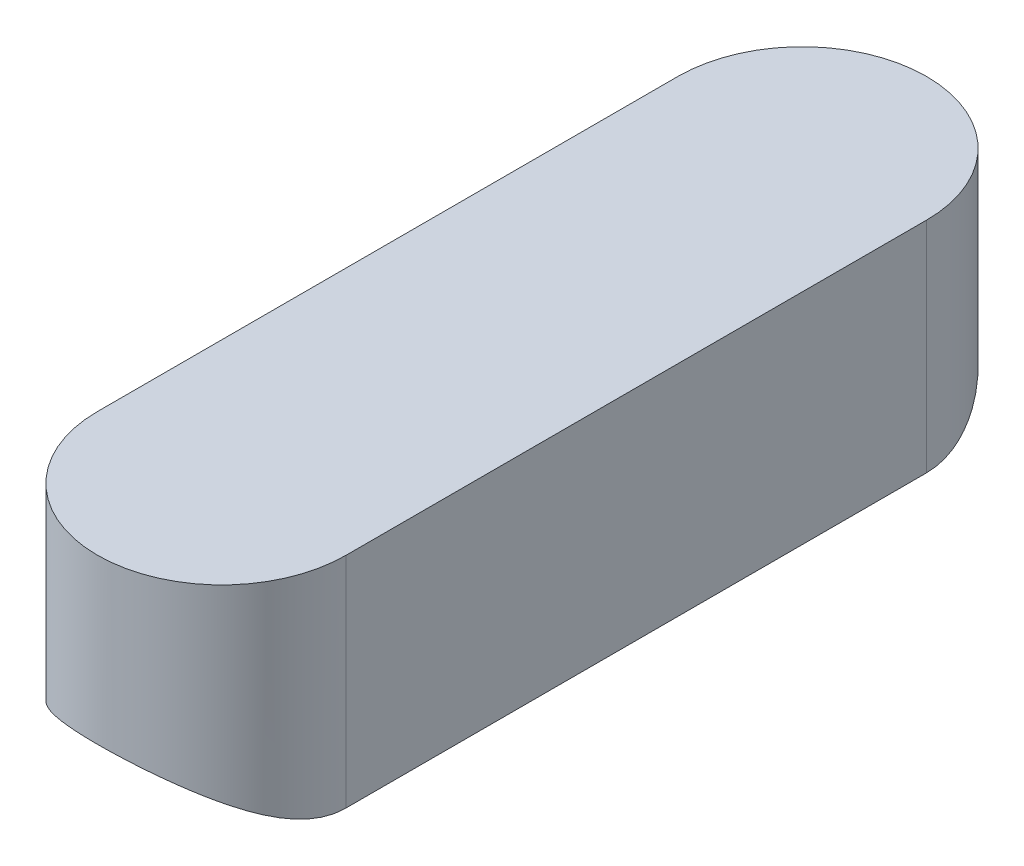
ISO-10303-21;
HEADER;
FILE_DESCRIPTION(('STEP AP214'),'2;1');
FILE_NAME('part.step','',(''),(''),'','','');
FILE_SCHEMA(('AUTOMOTIVE_DESIGN { 1 0 10303 214 1 1 1 1 }'));
ENDSEC;
DATA;
#1=APPLICATION_CONTEXT('core data for automotive mechanical design processes');
#2=APPLICATION_PROTOCOL_DEFINITION('international standard','automotive_design',2000,#1);
#3=PRODUCT_CONTEXT('',#1,'mechanical');
#4=PRODUCT('Part','Part','',(#3));
#5=PRODUCT_RELATED_PRODUCT_CATEGORY('part','',(#4));
#6=PRODUCT_DEFINITION_FORMATION('','',#4);
#7=PRODUCT_DEFINITION_CONTEXT('part definition',#1,'design');
#8=PRODUCT_DEFINITION('design','',#6,#7);
#9=PRODUCT_DEFINITION_SHAPE('','',#8);
#10=(LENGTH_UNIT() NAMED_UNIT(*) SI_UNIT(.MILLI.,.METRE.));
#11=(NAMED_UNIT(*) PLANE_ANGLE_UNIT() SI_UNIT($,.RADIAN.));
#12=(NAMED_UNIT(*) SI_UNIT($,.STERADIAN.) SOLID_ANGLE_UNIT());
#13=UNCERTAINTY_MEASURE_WITH_UNIT(LENGTH_MEASURE(1.E-05),#10,'distance_accuracy_value','');
#14=(GEOMETRIC_REPRESENTATION_CONTEXT(3) GLOBAL_UNCERTAINTY_ASSIGNED_CONTEXT((#13)) GLOBAL_UNIT_ASSIGNED_CONTEXT((#10,
#11,#12)) REPRESENTATION_CONTEXT('',''));
#15=CARTESIAN_POINT('',(0.,0.,0.));
#16=DIRECTION('',(0.,0.,1.));
#17=DIRECTION('',(1.,0.,0.));
#18=AXIS2_PLACEMENT_3D('',#15,#16,#17);
#19=CARTESIAN_POINT('',(0.,0.,20.));
#20=DIRECTION('',(0.,0.,-1.));
#21=DIRECTION('',(-1.,0.,0.));
#22=AXIS2_PLACEMENT_3D('',#19,#20,#21);
#23=CYLINDRICAL_SURFACE('',#22,4.05);
#24=CARTESIAN_POINT('',(3.,2.72075357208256,3.));
#25=CARTESIAN_POINT('',(3.00002247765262,2.72069902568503,2.92893320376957));
#26=CARTESIAN_POINT('',(2.9974758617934,2.72353662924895,2.85790350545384));
#27=CARTESIAN_POINT('',(2.98742856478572,2.73456916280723,2.71675055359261));
#28=CARTESIAN_POINT('',(2.97993767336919,2.74275350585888,2.64662578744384));
#29=CARTESIAN_POINT('',(2.96030761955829,2.76392301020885,2.50869301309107));
#30=CARTESIAN_POINT('',(2.94822749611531,2.77684712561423,2.4408670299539));
#31=CARTESIAN_POINT('',(2.91968140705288,2.80684745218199,2.30707661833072));
#32=CARTESIAN_POINT('',(2.90321345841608,2.82392554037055,2.24111304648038));
#33=CARTESIAN_POINT('',(2.84793349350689,2.8800177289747,2.04754165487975));
#34=CARTESIAN_POINT('',(2.80307107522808,2.92409137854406,1.92308432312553));
#35=CARTESIAN_POINT('',(2.69888349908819,3.02052769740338,1.68348791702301));
#36=CARTESIAN_POINT('',(2.63950627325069,3.07291996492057,1.56838442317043));
#37=CARTESIAN_POINT('',(2.494211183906,3.19247958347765,1.32587832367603));
#38=CARTESIAN_POINT('',(2.40535804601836,3.26050118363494,1.20064763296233));
#39=CARTESIAN_POINT('',(2.2095996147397,3.39623719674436,0.965012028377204));
#40=CARTESIAN_POINT('',(2.10268421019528,3.46395141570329,0.854615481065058));
#41=CARTESIAN_POINT('',(1.84834056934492,3.60712007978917,0.629822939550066));
#42=CARTESIAN_POINT('',(1.69708084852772,3.68146836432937,0.518929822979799));
#43=CARTESIAN_POINT('',(1.4532080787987,3.78132761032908,0.373759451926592));
#44=CARTESIAN_POINT('',(1.36911059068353,3.81266355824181,0.328906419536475));
#45=CARTESIAN_POINT('',(1.19569606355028,3.87054975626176,0.246910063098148));
#46=CARTESIAN_POINT('',(1.10638171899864,3.89710244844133,0.209762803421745));
#47=CARTESIAN_POINT('',(0.885804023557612,3.95418137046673,0.130489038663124));
#48=CARTESIAN_POINT('',(0.752275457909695,3.98191883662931,0.0925002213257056));
#49=CARTESIAN_POINT('',(0.479292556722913,4.02390655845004,0.0352565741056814));
#50=CARTESIAN_POINT('',(0.339843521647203,4.03816862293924,0.0159853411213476));
#51=CARTESIAN_POINT('',(0.0585161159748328,4.05202974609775,-0.00274654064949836));
#52=CARTESIAN_POINT('',(-0.0833674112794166,4.05159244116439,-0.00215806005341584));
#53=CARTESIAN_POINT('',(-0.364830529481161,4.03599796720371,0.0189215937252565));
#54=CARTESIAN_POINT('',(-0.504409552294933,4.02083722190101,0.0394176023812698));
#55=CARTESIAN_POINT('',(-0.772870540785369,3.97782350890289,0.0981107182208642));
#56=CARTESIAN_POINT('',(-0.901952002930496,3.95039314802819,0.135719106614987));
#57=CARTESIAN_POINT('',(-1.15156555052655,3.88497957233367,0.226633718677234));
#58=CARTESIAN_POINT('',(-1.27209574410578,3.84699403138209,0.279943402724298));
#59=CARTESIAN_POINT('',(-1.51553866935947,3.75821963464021,0.406931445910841));
#60=CARTESIAN_POINT('',(-1.63727105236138,3.70648501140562,0.482199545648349));
#61=CARTESIAN_POINT('',(-1.86694337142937,3.59628715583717,0.647432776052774));
#62=CARTESIAN_POINT('',(-1.97487171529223,3.53781834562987,0.737410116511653));
#63=CARTESIAN_POINT('',(-2.19579117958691,3.40596149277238,0.94908676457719));
#64=CARTESIAN_POINT('',(-2.30571612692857,3.3318767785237,1.07355491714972));
#65=CARTESIAN_POINT('',(-2.50417490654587,3.18540395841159,1.33967100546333));
#66=CARTESIAN_POINT('',(-2.59269126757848,3.11301728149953,1.48133283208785));
#67=CARTESIAN_POINT('',(-2.73062889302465,2.99211943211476,1.750370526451));
#68=CARTESIAN_POINT('',(-2.7843459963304,2.94175845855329,1.87470193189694));
#69=CARTESIAN_POINT('',(-2.87518758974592,2.8530391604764,2.1328923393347));
#70=CARTESIAN_POINT('',(-2.91238980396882,2.81462487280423,2.26670319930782));
#71=CARTESIAN_POINT('',(-2.95976876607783,2.76461277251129,2.50059787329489));
#72=CARTESIAN_POINT('',(-2.97470902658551,2.74842404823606,2.59871613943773));
#73=CARTESIAN_POINT('',(-2.98980689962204,2.73196023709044,2.74784407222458));
#74=CARTESIAN_POINT('',(-2.99362116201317,2.72777467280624,2.79808040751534));
#75=CARTESIAN_POINT('',(-2.99872079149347,2.72216458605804,2.89887187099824));
#76=CARTESIAN_POINT('',(-3.0000042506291,2.72074214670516,2.94942721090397));
#77=CARTESIAN_POINT('',(-3.,2.72075357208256,3.));
#78=B_SPLINE_CURVE_WITH_KNOTS('',3,(#24,#25,#26,#27,#28,#29,#30,#31,#32,#33,#34,#35,#36,#37,#38,
#39,#40,#41,#42,#43,#44,#45,#46,#47,#48,#49,#50,#51,#52,#53,#54,#55,#56,#57,#58,#59,#60,#61,#62,
#63,#64,#65,#66,#67,#68,#69,#70,#71,#72,#73,#74,#75,#76,#77),.UNSPECIFIED.,.F.,.F.,(4,2,2,2,2,2,
2,2,2,2,2,2,2,2,2,2,2,2,2,2,2,2,2,2,2,2,4),(0.,0.213038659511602,0.425656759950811,
0.635627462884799,0.845693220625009,1.26227494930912,1.68037356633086,2.18243291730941,
2.68477425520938,3.28615805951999,3.5866944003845,3.88707686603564,4.30984375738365,
4.73223982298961,5.15568089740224,5.57922484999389,5.98918653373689,6.39923863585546,
6.8541239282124,7.30938874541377,7.85280607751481,8.39666539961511,8.82878871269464,
9.25885618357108,9.55952855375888,9.71106423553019,9.86271411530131),.UNSPECIFIED.);
#79=CARTESIAN_POINT('',(3.,2.72075357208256,3.));
#80=VERTEX_POINT('',#79);
#81=CARTESIAN_POINT('',(-3.,2.72075357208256,3.));
#82=VERTEX_POINT('',#81);
#83=EDGE_CURVE('E57',#80,#82,#78,.T.);
#84=ORIENTED_EDGE('',*,*,#83,.F.);
#85=DIRECTION('',(0.,0.,-1.));
#86=VECTOR('',#85,1.);
#87=CARTESIAN_POINT('',(3.,2.72075357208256,20.));
#88=LINE('',#87,#86);
#89=CARTESIAN_POINT('',(3.,2.72075357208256,17.));
#90=VERTEX_POINT('',#89);
#91=EDGE_CURVE('E12',#90,#80,#88,.T.);
#92=ORIENTED_EDGE('',*,*,#91,.F.);
#93=CARTESIAN_POINT('',(-3.,2.72075357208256,17.));
#94=CARTESIAN_POINT('',(-3.00002247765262,2.72069902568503,17.0710667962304));
#95=CARTESIAN_POINT('',(-2.99747586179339,2.72353662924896,17.1420964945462));
#96=CARTESIAN_POINT('',(-2.98742856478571,2.73456916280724,17.2832494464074));
#97=CARTESIAN_POINT('',(-2.97993767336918,2.74275350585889,17.3533742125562));
#98=CARTESIAN_POINT('',(-2.96030761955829,2.76392301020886,17.4913069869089));
#99=CARTESIAN_POINT('',(-2.9482274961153,2.77684712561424,17.5591329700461));
#100=CARTESIAN_POINT('',(-2.91968140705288,2.80684745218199,17.6929233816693));
#101=CARTESIAN_POINT('',(-2.90321345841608,2.82392554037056,17.7588869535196));
#102=CARTESIAN_POINT('',(-2.84793349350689,2.8800177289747,17.9524583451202));
#103=CARTESIAN_POINT('',(-2.80307107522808,2.92409137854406,18.0769156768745));
#104=CARTESIAN_POINT('',(-2.69888349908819,3.02052769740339,18.316512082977));
#105=CARTESIAN_POINT('',(-2.63950627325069,3.07291996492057,18.4316155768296));
#106=CARTESIAN_POINT('',(-2.494211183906,3.19247958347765,18.674121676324));
#107=CARTESIAN_POINT('',(-2.40535804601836,3.26050118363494,18.7993523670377));
#108=CARTESIAN_POINT('',(-2.2095996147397,3.39623719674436,19.0349879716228));
#109=CARTESIAN_POINT('',(-2.10268421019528,3.4639514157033,19.1453845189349));
#110=CARTESIAN_POINT('',(-1.84834056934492,3.60712007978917,19.3701770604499));
#111=CARTESIAN_POINT('',(-1.69708084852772,3.68146836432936,19.4810701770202));
#112=CARTESIAN_POINT('',(-1.4532080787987,3.78132761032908,19.6262405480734));
#113=CARTESIAN_POINT('',(-1.36911059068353,3.81266355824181,19.6710935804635));
#114=CARTESIAN_POINT('',(-1.19569606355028,3.87054975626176,19.7530899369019));
#115=CARTESIAN_POINT('',(-1.10638171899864,3.89710244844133,19.7902371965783));
#116=CARTESIAN_POINT('',(-0.885804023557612,3.95418137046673,19.8695109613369));
#117=CARTESIAN_POINT('',(-0.752275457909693,3.98191883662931,19.9074997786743));
#118=CARTESIAN_POINT('',(-0.47929255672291,4.02390655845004,19.9647434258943));
#119=CARTESIAN_POINT('',(-0.339843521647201,4.03816862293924,19.9840146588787));
#120=CARTESIAN_POINT('',(-0.0585161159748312,4.05202974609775,20.0027465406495));
#121=CARTESIAN_POINT('',(0.0833674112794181,4.05159244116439,20.0021580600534));
#122=CARTESIAN_POINT('',(0.364830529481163,4.03599796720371,19.9810784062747));
#123=CARTESIAN_POINT('',(0.504409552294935,4.02083722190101,19.9605823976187));
#124=CARTESIAN_POINT('',(0.772870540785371,3.97782350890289,19.9018892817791));
#125=CARTESIAN_POINT('',(0.901952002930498,3.95039314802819,19.864280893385));
#126=CARTESIAN_POINT('',(1.15156555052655,3.88497957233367,19.7733662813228));
#127=CARTESIAN_POINT('',(1.27209574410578,3.84699403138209,19.7200565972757));
#128=CARTESIAN_POINT('',(1.51553866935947,3.75821963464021,19.5930685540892));
#129=CARTESIAN_POINT('',(1.63727105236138,3.70648501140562,19.5178004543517));
#130=CARTESIAN_POINT('',(1.86694337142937,3.59628715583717,19.3525672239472));
#131=CARTESIAN_POINT('',(1.97487171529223,3.53781834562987,19.2625898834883));
#132=CARTESIAN_POINT('',(2.19579117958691,3.40596149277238,19.0509132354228));
#133=CARTESIAN_POINT('',(2.30571612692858,3.3318767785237,18.9264450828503));
#134=CARTESIAN_POINT('',(2.50417490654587,3.18540395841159,18.6603289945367));
#135=CARTESIAN_POINT('',(2.59269126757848,3.11301728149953,18.5186671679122));
#136=CARTESIAN_POINT('',(2.73062889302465,2.99211943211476,18.249629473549));
#137=CARTESIAN_POINT('',(2.7843459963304,2.94175845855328,18.1252980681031));
#138=CARTESIAN_POINT('',(2.87518758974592,2.85303916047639,17.8671076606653));
#139=CARTESIAN_POINT('',(2.91238980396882,2.81462487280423,17.7332968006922));
#140=CARTESIAN_POINT('',(2.95976876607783,2.76461277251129,17.4994021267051));
#141=CARTESIAN_POINT('',(2.97470902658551,2.74842404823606,17.4012838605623));
#142=CARTESIAN_POINT('',(2.98980689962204,2.73196023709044,17.2521559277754));
#143=CARTESIAN_POINT('',(2.99362116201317,2.72777467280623,17.2019195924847));
#144=CARTESIAN_POINT('',(2.99872079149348,2.72216458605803,17.1011281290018));
#145=CARTESIAN_POINT('',(3.00000425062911,2.72074214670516,17.050572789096));
#146=CARTESIAN_POINT('',(3.,2.72075357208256,17.));
#147=B_SPLINE_CURVE_WITH_KNOTS('',3,(#93,#94,#95,#96,#97,#98,#99,#100,#101,#102,#103,#104,#105,
#106,#107,#108,#109,#110,#111,#112,#113,#114,#115,#116,#117,#118,#119,#120,#121,#122,#123,#124,
#125,#126,#127,#128,#129,#130,#131,#132,#133,#134,#135,#136,#137,#138,#139,#140,#141,#142,#143,
#144,#145,#146),.UNSPECIFIED.,.F.,.F.,(4,2,2,2,2,2,2,2,2,2,2,2,2,2,2,2,2,2,2,2,2,2,2,2,2,2,4),
(0.,0.213038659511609,0.425656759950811,0.635627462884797,0.845693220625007,1.26227494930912,
1.68037356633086,2.18243291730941,2.68477425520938,3.28615805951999,3.5866944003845,
3.88707686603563,4.30984375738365,4.73223982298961,5.15568089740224,5.57922484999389,
5.98918653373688,6.39923863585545,6.8541239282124,7.30938874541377,7.8528060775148,
8.39666539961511,8.82878871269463,9.25885618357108,9.55952855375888,9.71106423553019,
9.86271411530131),.UNSPECIFIED.);
#148=CARTESIAN_POINT('',(-3.,2.72075357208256,17.));
#149=VERTEX_POINT('',#148);
#150=EDGE_CURVE('E74',#149,#90,#147,.T.);
#151=ORIENTED_EDGE('',*,*,#150,.F.);
#152=DIRECTION('',(0.,0.,-1.));
#153=VECTOR('',#152,1.);
#154=CARTESIAN_POINT('',(-3.,2.72075357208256,20.));
#155=LINE('',#154,#153);
#156=EDGE_CURVE('E84',#149,#82,#155,.T.);
#157=ORIENTED_EDGE('',*,*,#156,.T.);
#158=EDGE_LOOP('',(#84,#92,#151,#157));
#159=FACE_BOUND('',#158,.T.);
#160=ADVANCED_FACE('F34',(#159),#23,.F.);
#161=CARTESIAN_POINT('',(3.,2.72075357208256,20.));
#162=DIRECTION('',(-1.,0.,0.));
#163=DIRECTION('',(0.,0.,1.));
#164=AXIS2_PLACEMENT_3D('',#161,#162,#163);
#165=PLANE('',#164);
#166=ORIENTED_EDGE('',*,*,#91,.T.);
#167=DIRECTION('',(0.,1.,0.));
#168=VECTOR('',#167,1.);
#169=CARTESIAN_POINT('',(3.,2.72075357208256,3.));
#170=LINE('',#169,#168);
#171=CARTESIAN_POINT('',(3.,8.,3.));
#172=VERTEX_POINT('',#171);
#173=EDGE_CURVE('E90',#80,#172,#170,.T.);
#174=ORIENTED_EDGE('',*,*,#173,.T.);
#175=DIRECTION('',(0.,0.,-1.));
#176=VECTOR('',#175,1.);
#177=CARTESIAN_POINT('',(3.,8.,20.));
#178=LINE('',#177,#176);
#179=CARTESIAN_POINT('',(3.,8.,17.));
#180=VERTEX_POINT('',#179);
#181=EDGE_CURVE('E42',#180,#172,#178,.T.);
#182=ORIENTED_EDGE('',*,*,#181,.F.);
#183=DIRECTION('',(0.,1.,0.));
#184=VECTOR('',#183,1.);
#185=CARTESIAN_POINT('',(3.,2.72075357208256,17.));
#186=LINE('',#185,#184);
#187=EDGE_CURVE('E77',#90,#180,#186,.T.);
#188=ORIENTED_EDGE('',*,*,#187,.F.);
#189=EDGE_LOOP('',(#166,#174,#182,#188));
#190=FACE_BOUND('',#189,.T.);
#191=ADVANCED_FACE('F87',(#190),#165,.F.);
#192=CARTESIAN_POINT('',(3.,8.,20.));
#193=DIRECTION('',(0.,-1.,0.));
#194=DIRECTION('',(0.,0.,-1.));
#195=AXIS2_PLACEMENT_3D('',#192,#193,#194);
#196=PLANE('',#195);
#197=CARTESIAN_POINT('',(0.,8.,3.));
#198=DIRECTION('',(0.,1.,0.));
#199=DIRECTION('',(0.,0.,1.));
#200=AXIS2_PLACEMENT_3D('',#197,#198,#199);
#201=CIRCLE('',#200,3.);
#202=CARTESIAN_POINT('',(-3.,8.,3.));
#203=VERTEX_POINT('',#202);
#204=EDGE_CURVE('E158',#172,#203,#201,.T.);
#205=ORIENTED_EDGE('',*,*,#204,.T.);
#206=DIRECTION('',(0.,0.,-1.));
#207=VECTOR('',#206,1.);
#208=CARTESIAN_POINT('',(-3.,8.,20.));
#209=LINE('',#208,#207);
#210=CARTESIAN_POINT('',(-3.,8.,17.));
#211=VERTEX_POINT('',#210);
#212=EDGE_CURVE('E160',#211,#203,#209,.T.);
#213=ORIENTED_EDGE('',*,*,#212,.F.);
#214=CARTESIAN_POINT('',(0.,8.,17.));
#215=DIRECTION('',(0.,1.,0.));
#216=DIRECTION('',(0.,0.,1.));
#217=AXIS2_PLACEMENT_3D('',#214,#215,#216);
#218=CIRCLE('',#217,3.);
#219=EDGE_CURVE('E49',#211,#180,#218,.T.);
#220=ORIENTED_EDGE('',*,*,#219,.T.);
#221=ORIENTED_EDGE('',*,*,#181,.T.);
#222=EDGE_LOOP('',(#205,#213,#220,#221));
#223=FACE_BOUND('',#222,.T.);
#224=ADVANCED_FACE('F114',(#223),#196,.F.);
#225=CARTESIAN_POINT('',(-3.,2.72075357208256,20.));
#226=DIRECTION('',(1.,0.,0.));
#227=DIRECTION('',(0.,0.,-1.));
#228=AXIS2_PLACEMENT_3D('',#225,#226,#227);
#229=PLANE('',#228);
#230=DIRECTION('',(0.,1.,0.));
#231=VECTOR('',#230,1.);
#232=CARTESIAN_POINT('',(-3.,2.72075357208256,3.));
#233=LINE('',#232,#231);
#234=EDGE_CURVE('E99',#82,#203,#233,.T.);
#235=ORIENTED_EDGE('',*,*,#234,.F.);
#236=ORIENTED_EDGE('',*,*,#156,.F.);
#237=DIRECTION('',(0.,1.,0.));
#238=VECTOR('',#237,1.);
#239=CARTESIAN_POINT('',(-3.,2.72075357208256,17.));
#240=LINE('',#239,#238);
#241=EDGE_CURVE('E79',#149,#211,#240,.T.);
#242=ORIENTED_EDGE('',*,*,#241,.T.);
#243=ORIENTED_EDGE('',*,*,#212,.T.);
#244=EDGE_LOOP('',(#235,#236,#242,#243));
#245=FACE_BOUND('',#244,.T.);
#246=ADVANCED_FACE('F111',(#245),#229,.F.);
#247=CARTESIAN_POINT('',(0.,2.72075357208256,17.));
#248=DIRECTION('',(0.,1.,0.));
#249=DIRECTION('',(0.,0.,1.));
#250=AXIS2_PLACEMENT_3D('',#247,#248,#249);
#251=CYLINDRICAL_SURFACE('',#250,3.);
#252=ORIENTED_EDGE('',*,*,#150,.T.);
#253=ORIENTED_EDGE('',*,*,#187,.T.);
#254=ORIENTED_EDGE('',*,*,#219,.F.);
#255=ORIENTED_EDGE('',*,*,#241,.F.);
#256=EDGE_LOOP('',(#252,#253,#254,#255));
#257=FACE_BOUND('',#256,.T.);
#258=ADVANCED_FACE('F76',(#257),#251,.T.);
#259=CARTESIAN_POINT('',(0.,2.72075357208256,3.));
#260=DIRECTION('',(0.,1.,0.));
#261=DIRECTION('',(0.,0.,1.));
#262=AXIS2_PLACEMENT_3D('',#259,#260,#261);
#263=CYLINDRICAL_SURFACE('',#262,3.);
#264=ORIENTED_EDGE('',*,*,#83,.T.);
#265=ORIENTED_EDGE('',*,*,#234,.T.);
#266=ORIENTED_EDGE('',*,*,#204,.F.);
#267=ORIENTED_EDGE('',*,*,#173,.F.);
#268=EDGE_LOOP('',(#264,#265,#266,#267));
#269=FACE_BOUND('',#268,.T.);
#270=ADVANCED_FACE('F106',(#269),#263,.T.);
#271=CLOSED_SHELL('',(#160,#191,#224,#246,#258,#270));
#272=MANIFOLD_SOLID_BREP('B2',#271);
#273=ADVANCED_BREP_SHAPE_REPRESENTATION('',(#18,#272),#14);
#274=SHAPE_DEFINITION_REPRESENTATION(#9,#273);
ENDSEC;
END-ISO-10303-21;
